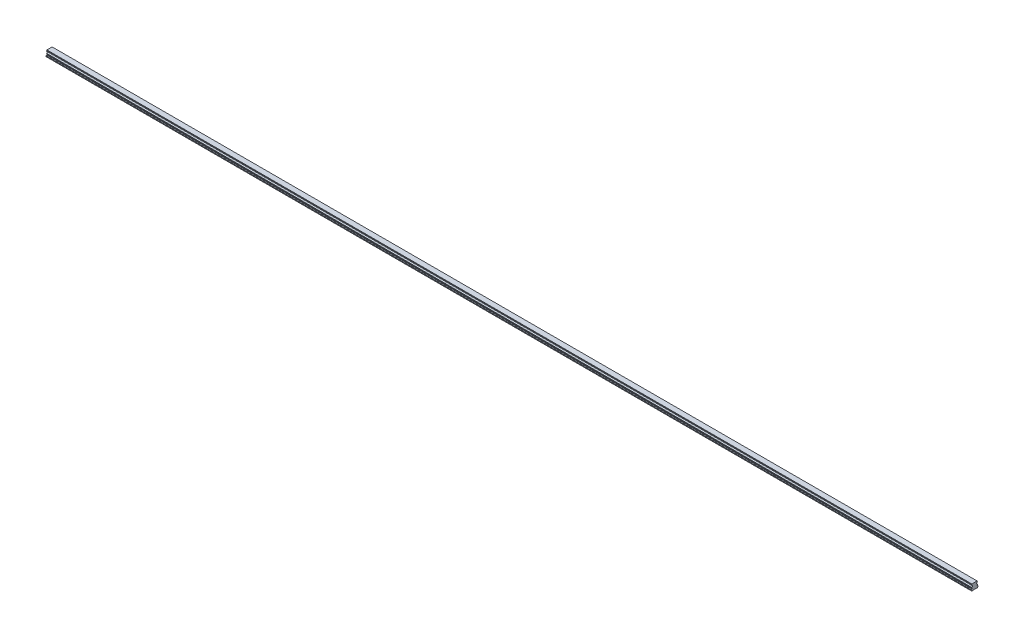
from build123d import *

# Parameters (mm, degrees)
BOSS_EXTRUDE1_DEPTH        = 3300
SKETCH3_R                  = 3
SKETCH3_R_2                = 2.5
CUT_EXTRUDE3_DEPTH         = 12
SKETCH3_2_R                = 2.5
CUT_EXTRUDE4_DEPTH         = 15
CHAMFER1_SIZE              = 0.5
LPATTERN4_COUNT            = 55
LPATTERN4_PITCH            = 60
CHAMFER1_OF_LPATTERN4_SIZE = 0.5


with BuildPart() as part:
    # Sketch1 → Boss-Extrude1 (new body)
    with BuildSketch(Plane(origin=(0, 0, 0), x_dir=(0, 0, -1), z_dir=(1, 0, 0))):
        with BuildLine():
            Line((9.375, 21.8), (-9.375, 21.8))
            Line((-9.375, 21.8), (-9.375, 20.756))
            Line((-9.375, 20.756), (-10, 19.415683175))
            Line((-10, 19.415683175), (-10, 17.685449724))
            ThreePointArc((-10, 17.685449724), (-7.2, 14.6), (-10, 11.514550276))
            Line((-10, 11.514550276), (-10, 9.784316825))
            Line((-10, 9.784316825), (-9.375, 8.444))
            Line((-9.375, 8.444), (-9.922688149, 6.4))
            Line((-9.922688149, 6.4), (-12.5, 5.489338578))
            Line((-12.5, 5.489338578), (-12.5, 2.65))
            Line((-12.5, 2.65), (-9.85, 0))
            Line((-9.85, 0), (-5.5, 0))
            Line((-5.5, 0), (-5, 0.5))
            Line((-5, 0.5), (5, 0.5))
            Line((5, 0.5), (5.5, 0))
            Line((5.5, 0), (9.85, 0))
            Line((9.85, 0), (12.5, 2.65))
            Line((12.5, 2.65), (12.5, 5.489338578))
            Line((12.5, 5.489338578), (9.922688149, 6.4))
            Line((9.922688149, 6.4), (9.375, 8.444))
            Line((9.375, 8.444), (10, 9.784316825))
            Line((10, 9.784316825), (10, 11.514550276))
            ThreePointArc((10, 11.514550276), (7.2, 14.6), (10, 17.685449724))
            Line((10, 17.685449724), (10, 19.415683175))
            Line((10, 19.415683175), (9.375, 20.756))
            Line((9.375, 20.756), (9.375, 21.8))
        make_face()
    extrude(amount=BOSS_EXTRUDE1_DEPTH)

    # Sketch3 → Cut-Extrude3 (cut)
    with BuildSketch(Plane.XZ):
        with Locations(Location((30, 0, 0), (0, 0, 270))):
            Circle(SKETCH3_R)
        with Locations(Location((30, 0, 0), (0, 0, 270))):
            Circle(SKETCH3_R_2, mode=Mode.SUBTRACT)
    cut_extrude3 = extrude(amount=-CUT_EXTRUDE3_DEPTH, mode=Mode.SUBTRACT)

    # Sketch3_2 → Cut-Extrude4 (cut)
    with BuildSketch(Plane.XZ):
        with Locations(Location((30, 0, 0), (0, 0, 270))):
            Circle(SKETCH3_2_R)
    cut_extrude4 = extrude(amount=-CUT_EXTRUDE4_DEPTH, mode=Mode.SUBTRACT)

    # Cut-Extrude5 cone 1 section (on through the dimple's axis) → Cut-Extrude5 (revolve, cut)
    with BuildSketch(Plane(origin=(30, 15, 0), x_dir=(0, 0, -1), z_dir=(1, 0, 0))):
        Polygon((0, 0), (2.5, 0), (0, 1.443375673), align=None)
    cut_extrude5 = revolve(axis=Axis((30, 15, 0), (0, 1, 0)), mode=Mode.SUBTRACT)

    # Chamfer1
    chamfer1_edges = [part.edges().sort_by_distance(p)[0] for p in [
        (30, 0.5, 3),
    ]]
    chamfer(chamfer1_edges, length=CHAMFER1_SIZE)

    # LPattern4: Cut-Extrude3, Cut-Extrude4, Cut-Extrude5 ×55
    with Locations(*[(i * LPATTERN4_PITCH, 0, 0) for i in range(1, LPATTERN4_COUNT)]):
        add(cut_extrude3, mode=Mode.SUBTRACT)
        add(cut_extrude4, mode=Mode.SUBTRACT)
        add(cut_extrude5, mode=Mode.SUBTRACT)

    # Chamfer1 of LPattern4
    chamfer1_of_lpattern4_edges = [part.edges().sort_by_distance(p)[0] for p in [
        (90, 0.5, 3),
        (150, 0.5, 3),
        (210, 0.5, 3),
        (270, 0.5, 3),
        (330, 0.5, 3),
        (390, 0.5, 3),
        (450, 0.5, 3),
        (510, 0.5, 3),
        (570, 0.5, 3),
        (630, 0.5, 3),
        (690, 0.5, 3),
        (750, 0.5, 3),
        (810, 0.5, 3),
        (870, 0.5, 3),
        (930, 0.5, 3),
        (990, 0.5, 3),
        (1050, 0.5, 3),
        (1110, 0.5, 3),
        (1170, 0.5, 3),
        (1230, 0.5, 3),
        (1290, 0.5, 3),
        (1350, 0.5, 3),
        (1410, 0.5, 3),
        (1470, 0.5, 3),
        (1530, 0.5, 3),
        (1590, 0.5, 3),
        (1650, 0.5, 3),
        (1710, 0.5, 3),
        (1770, 0.5, 3),
        (1830, 0.5, 3),
        (1890, 0.5, 3),
        (1950, 0.5, 3),
        (2010, 0.5, 3),
        (2070, 0.5, 3),
        (2130, 0.5, 3),
        (2190, 0.5, 3),
        (2250, 0.5, 3),
        (2310, 0.5, 3),
        (2370, 0.5, 3),
        (2430, 0.5, 3),
        (2490, 0.5, 3),
        (2550, 0.5, 3),
        (2610, 0.5, 3),
        (2670, 0.5, 3),
        (2730, 0.5, 3),
        (2790, 0.5, 3),
        (2850, 0.5, 3),
        (2910, 0.5, 3),
        (2970, 0.5, 3),
        (3030, 0.5, 3),
        (3090, 0.5, 3),
        (3150, 0.5, 3),
        (3210, 0.5, 3),
        (3270, 0.5, 3),
    ]]
    chamfer(chamfer1_of_lpattern4_edges, length=CHAMFER1_OF_LPATTERN4_SIZE)


solid = part.part
